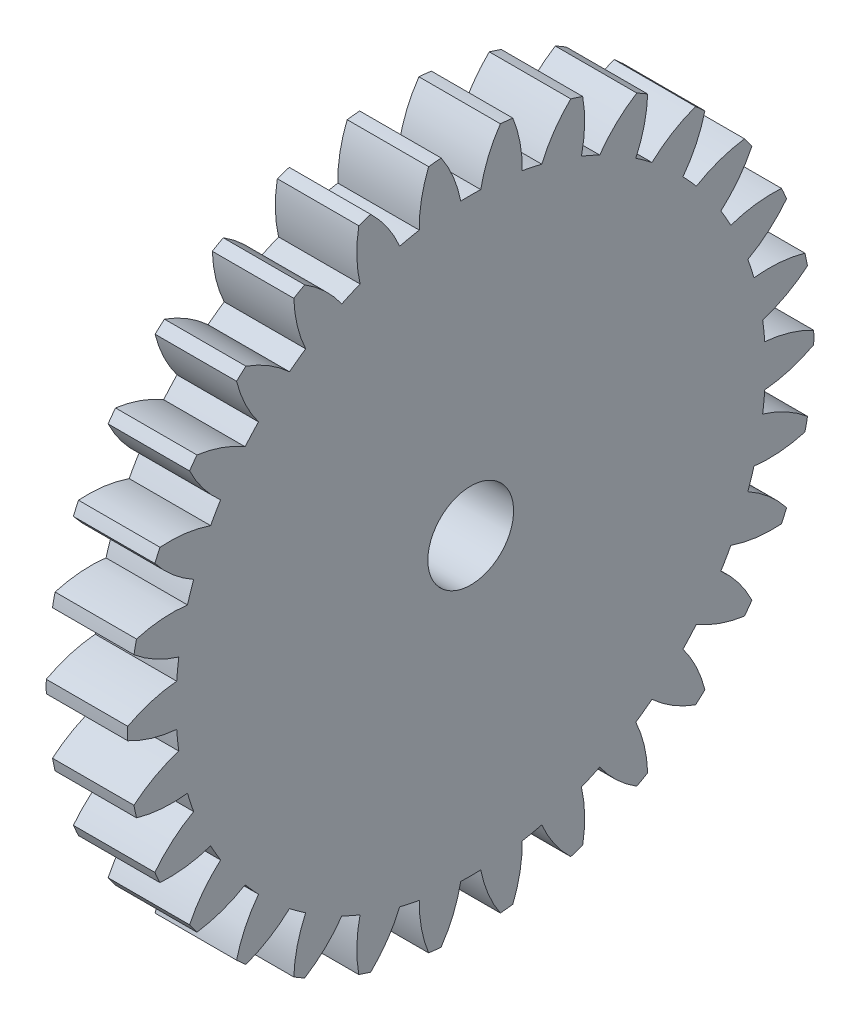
from build123d import *

# Parameters (mm, degrees)
BASPROSKE_W      = 1.9
BASPROSKE_H      = 8
TOOTHCUT_DEPTH   = 12.472140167
TEETHCUTS_COUNT  = 30
BORSKE_R         = 1
BORE_DEPTH       = 50.0000508
ESQUISSE1_R      = 2
ESQUISSE1_R_2    = 1
EXTRUSION1_DEPTH = 0.4


with BuildPart() as part:
    # BasProSke → Base-Revolve (revolve)
    with BuildSketch(Plane(origin=(0, 0, 0), x_dir=(1, 0, 0), z_dir=(0, 1, 0)), mode=Mode.PRIVATE) as base_revolve_sk:
        with Locations((0.95, 4)):
            Rectangle(BASPROSKE_W, BASPROSKE_H)
    revolve(base_revolve_sk.sketch.rotate(Axis((-10, 0, 0), (1, 0, 0)), 180), axis=Axis((-10, 0, 0), (1, 0, 0)))

    # TooCutSke → ToothCut (cut, through all)
    with BuildSketch(Plane(origin=(0, 0, 0), x_dir=(0, 0, -1), z_dir=(1, 0, 0))):
        with BuildLine():
            ThreePointArc((0.233102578, 6.87004652), (0, 6.874), (-0.233102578, 6.87004652))
            ThreePointArc((-0.233102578, 6.87004652), (-0.41229689, 7.456465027), (-0.706981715, 7.994199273))
            ThreePointArc((-0.706981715, 7.994199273), (0, 8.0254), (0.706981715, 7.994199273))
            ThreePointArc((0.706981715, 7.994199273), (0.41229689, 7.456465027), (0.233102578, 6.87004652))
        make_face()
    toothcut = extrude(amount=TOOTHCUT_DEPTH, mode=Mode.SUBTRACT)

    # TeethCuts: ToothCut ×30 about axis
    teethcuts_axis = Axis((0, 0, 0), (1, 0, 0))
    for i in range(1, TEETHCUTS_COUNT):
        add(toothcut.rotate(teethcuts_axis, i * 360 / TEETHCUTS_COUNT), mode=Mode.SUBTRACT)

    # BorSke → Bore (cut, symmetric)
    with BuildSketch(Plane(origin=(0, 0, 0), x_dir=(0, 0, -1), z_dir=(1, 0, 0))):
        with Locations(Location((0, 0, 0), (0, 0, 180))):
            Circle(BORSKE_R)
    extrude(amount=BORE_DEPTH, both=True, mode=Mode.SUBTRACT)

    # Esquisse1 → Extrusion1 (add)
    with BuildSketch(Plane.ZY):
        with Locations(Location((0, 0, 0), (0, 0, 180))):
            Circle(ESQUISSE1_R)
        Circle(ESQUISSE1_R_2, mode=Mode.SUBTRACT)
    extrude(amount=EXTRUSION1_DEPTH)


solid = part.part
